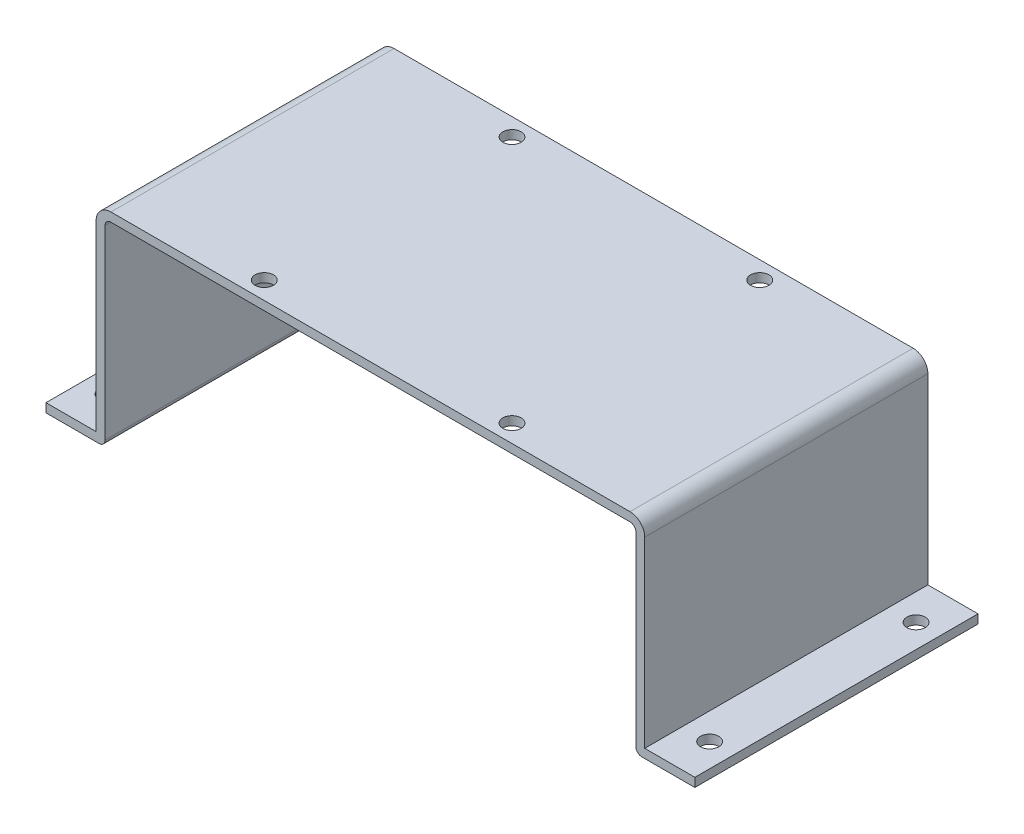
ISO-10303-21;
HEADER;
FILE_DESCRIPTION(('STEP AP214'),'2;1');
FILE_NAME('part.step','',(''),(''),'','','');
FILE_SCHEMA(('AUTOMOTIVE_DESIGN { 1 0 10303 214 1 1 1 1 }'));
ENDSEC;
DATA;
#1=APPLICATION_CONTEXT('core data for automotive mechanical design processes');
#2=APPLICATION_PROTOCOL_DEFINITION('international standard','automotive_design',2000,#1);
#3=PRODUCT_CONTEXT('',#1,'mechanical');
#4=PRODUCT('Part','Part','',(#3));
#5=PRODUCT_RELATED_PRODUCT_CATEGORY('part','',(#4));
#6=PRODUCT_DEFINITION_FORMATION('','',#4);
#7=PRODUCT_DEFINITION_CONTEXT('part definition',#1,'design');
#8=PRODUCT_DEFINITION('design','',#6,#7);
#9=PRODUCT_DEFINITION_SHAPE('','',#8);
#10=(LENGTH_UNIT() NAMED_UNIT(*) SI_UNIT(.MILLI.,.METRE.));
#11=(NAMED_UNIT(*) PLANE_ANGLE_UNIT() SI_UNIT($,.RADIAN.));
#12=(NAMED_UNIT(*) SI_UNIT($,.STERADIAN.) SOLID_ANGLE_UNIT());
#13=UNCERTAINTY_MEASURE_WITH_UNIT(LENGTH_MEASURE(1.E-05),#10,'distance_accuracy_value','');
#14=(GEOMETRIC_REPRESENTATION_CONTEXT(3) GLOBAL_UNCERTAINTY_ASSIGNED_CONTEXT((#13)) GLOBAL_UNIT_ASSIGNED_CONTEXT((#10,
#11,#12)) REPRESENTATION_CONTEXT('',''));
#15=CARTESIAN_POINT('',(0.,0.,0.));
#16=DIRECTION('',(0.,0.,1.));
#17=DIRECTION('',(1.,0.,0.));
#18=AXIS2_PLACEMENT_3D('',#15,#16,#17);
#19=CARTESIAN_POINT('',(-46.,1.5,24.));
#20=DIRECTION('',(0.,-1.,0.));
#21=DIRECTION('',(1.,0.,0.));
#22=AXIS2_PLACEMENT_3D('',#19,#20,#21);
#23=PLANE('',#22);
#24=CARTESIAN_POINT('',(-51.,1.5,17.5));
#25=DIRECTION('',(0.,-1.,0.));
#26=DIRECTION('',(1.,0.,0.));
#27=AXIS2_PLACEMENT_3D('',#24,#25,#26);
#28=CIRCLE('',#27,1.55);
#29=CARTESIAN_POINT('',(-49.45,1.5,17.5));
#30=VERTEX_POINT('',#29);
#31=EDGE_CURVE('E289',#30,#30,#28,.T.);
#32=ORIENTED_EDGE('',*,*,#31,.T.);
#33=EDGE_LOOP('',(#32));
#34=FACE_BOUND('',#33,.T.);
#35=CARTESIAN_POINT('',(-51.,1.5,-17.5));
#36=DIRECTION('',(0.,-1.,0.));
#37=DIRECTION('',(1.,0.,0.));
#38=AXIS2_PLACEMENT_3D('',#35,#36,#37);
#39=CIRCLE('',#38,1.55);
#40=CARTESIAN_POINT('',(-49.45,1.5,-17.5));
#41=VERTEX_POINT('',#40);
#42=EDGE_CURVE('E277',#41,#41,#39,.T.);
#43=ORIENTED_EDGE('',*,*,#42,.T.);
#44=EDGE_LOOP('',(#43));
#45=FACE_BOUND('',#44,.T.);
#46=DIRECTION('',(-1.,0.,0.));
#47=VECTOR('',#46,1.);
#48=CARTESIAN_POINT('',(-46.,1.5,-24.));
#49=LINE('',#48,#47);
#50=CARTESIAN_POINT('',(-46.5,1.5,-24.));
#51=VERTEX_POINT('',#50);
#52=CARTESIAN_POINT('',(-55.,1.5,-24.));
#53=VERTEX_POINT('',#52);
#54=EDGE_CURVE('E191',#51,#53,#49,.T.);
#55=ORIENTED_EDGE('',*,*,#54,.T.);
#56=DIRECTION('',(0.,0.,-1.));
#57=VECTOR('',#56,1.);
#58=CARTESIAN_POINT('',(-55.,1.5,24.));
#59=LINE('',#58,#57);
#60=CARTESIAN_POINT('',(-55.,1.5,24.));
#61=VERTEX_POINT('',#60);
#62=EDGE_CURVE('E11',#61,#53,#59,.T.);
#63=ORIENTED_EDGE('',*,*,#62,.F.);
#64=DIRECTION('',(-1.,0.,0.));
#65=VECTOR('',#64,1.);
#66=CARTESIAN_POINT('',(-46.,1.5,24.));
#67=LINE('',#66,#65);
#68=CARTESIAN_POINT('',(-46.5,1.5,24.));
#69=VERTEX_POINT('',#68);
#70=EDGE_CURVE('E122',#69,#61,#67,.T.);
#71=ORIENTED_EDGE('',*,*,#70,.F.);
#72=DIRECTION('',(0.,0.,-1.));
#73=VECTOR('',#72,1.);
#74=CARTESIAN_POINT('',(-46.5,1.5,24.));
#75=LINE('',#74,#73);
#76=EDGE_CURVE('E187',#69,#51,#75,.T.);
#77=ORIENTED_EDGE('',*,*,#76,.T.);
#78=EDGE_LOOP('',(#55,#63,#71,#77));
#79=FACE_BOUND('',#78,.T.);
#80=ADVANCED_FACE('F34',(#34,#45,#79),#23,.F.);
#81=CARTESIAN_POINT('',(-55.,0.,24.));
#82=DIRECTION('',(-1.,0.,0.));
#83=DIRECTION('',(0.,0.,1.));
#84=AXIS2_PLACEMENT_3D('',#81,#82,#83);
#85=PLANE('',#84);
#86=DIRECTION('',(0.,1.,0.));
#87=VECTOR('',#86,1.);
#88=CARTESIAN_POINT('',(-55.,0.,-24.));
#89=LINE('',#88,#87);
#90=CARTESIAN_POINT('',(-55.,0.,-24.));
#91=VERTEX_POINT('',#90);
#92=EDGE_CURVE('E194',#91,#53,#89,.T.);
#93=ORIENTED_EDGE('',*,*,#92,.F.);
#94=DIRECTION('',(0.,0.,-1.));
#95=VECTOR('',#94,1.);
#96=CARTESIAN_POINT('',(-55.,0.,24.));
#97=LINE('',#96,#95);
#98=CARTESIAN_POINT('',(-55.,0.,24.));
#99=VERTEX_POINT('',#98);
#100=EDGE_CURVE('E43',#99,#91,#97,.T.);
#101=ORIENTED_EDGE('',*,*,#100,.F.);
#102=DIRECTION('',(0.,1.,0.));
#103=VECTOR('',#102,1.);
#104=CARTESIAN_POINT('',(-55.,0.,24.));
#105=LINE('',#104,#103);
#106=EDGE_CURVE('E298',#99,#61,#105,.T.);
#107=ORIENTED_EDGE('',*,*,#106,.T.);
#108=ORIENTED_EDGE('',*,*,#62,.T.);
#109=EDGE_LOOP('',(#93,#101,#107,#108));
#110=FACE_BOUND('',#109,.T.);
#111=ADVANCED_FACE('F361',(#110),#85,.T.);
#112=CARTESIAN_POINT('',(-46.,0.,24.));
#113=DIRECTION('',(0.,-1.,0.));
#114=DIRECTION('',(1.,0.,0.));
#115=AXIS2_PLACEMENT_3D('',#112,#113,#114);
#116=PLANE('',#115);
#117=CARTESIAN_POINT('',(-51.,0.,17.5));
#118=DIRECTION('',(0.,-1.,0.));
#119=DIRECTION('',(1.,0.,0.));
#120=AXIS2_PLACEMENT_3D('',#117,#118,#119);
#121=CIRCLE('',#120,1.55);
#122=CARTESIAN_POINT('',(-49.45,0.,17.5));
#123=VERTEX_POINT('',#122);
#124=EDGE_CURVE('E37',#123,#123,#121,.T.);
#125=ORIENTED_EDGE('',*,*,#124,.F.);
#126=EDGE_LOOP('',(#125));
#127=FACE_BOUND('',#126,.T.);
#128=CARTESIAN_POINT('',(-51.,0.,-17.5));
#129=DIRECTION('',(0.,-1.,0.));
#130=DIRECTION('',(1.,0.,0.));
#131=AXIS2_PLACEMENT_3D('',#128,#129,#130);
#132=CIRCLE('',#131,1.55);
#133=CARTESIAN_POINT('',(-49.45,0.,-17.5));
#134=VERTEX_POINT('',#133);
#135=EDGE_CURVE('E275',#134,#134,#132,.T.);
#136=ORIENTED_EDGE('',*,*,#135,.F.);
#137=EDGE_LOOP('',(#136));
#138=FACE_BOUND('',#137,.T.);
#139=DIRECTION('',(-1.,0.,0.));
#140=VECTOR('',#139,1.);
#141=CARTESIAN_POINT('',(-46.,0.,-24.));
#142=LINE('',#141,#140);
#143=CARTESIAN_POINT('',(-46.,0.,-24.));
#144=VERTEX_POINT('',#143);
#145=EDGE_CURVE('E198',#144,#91,#142,.T.);
#146=ORIENTED_EDGE('',*,*,#145,.F.);
#147=DIRECTION('',(0.,0.,-1.));
#148=VECTOR('',#147,1.);
#149=CARTESIAN_POINT('',(-46.,0.,24.));
#150=LINE('',#149,#148);
#151=CARTESIAN_POINT('',(-46.,0.,24.));
#152=VERTEX_POINT('',#151);
#153=EDGE_CURVE('E264',#152,#144,#150,.T.);
#154=ORIENTED_EDGE('',*,*,#153,.F.);
#155=DIRECTION('',(-1.,0.,0.));
#156=VECTOR('',#155,1.);
#157=CARTESIAN_POINT('',(-46.,0.,24.));
#158=LINE('',#157,#156);
#159=EDGE_CURVE('E301',#152,#99,#158,.T.);
#160=ORIENTED_EDGE('',*,*,#159,.T.);
#161=ORIENTED_EDGE('',*,*,#100,.T.);
#162=EDGE_LOOP('',(#146,#154,#160,#161));
#163=FACE_BOUND('',#162,.T.);
#164=ADVANCED_FACE('F366',(#127,#138,#163),#116,.T.);
#165=CARTESIAN_POINT('',(-46.,1.,24.));
#166=DIRECTION('',(0.,0.,-1.));
#167=DIRECTION('',(-1.,0.,0.));
#168=AXIS2_PLACEMENT_3D('',#165,#166,#167);
#169=CYLINDRICAL_SURFACE('',#168,1.);
#170=CARTESIAN_POINT('',(-46.,1.,-24.));
#171=DIRECTION('',(0.,0.,-1.));
#172=DIRECTION('',(-1.,0.,0.));
#173=AXIS2_PLACEMENT_3D('',#170,#171,#172);
#174=CIRCLE('',#173,1.);
#175=CARTESIAN_POINT('',(-45.,1.,-24.));
#176=VERTEX_POINT('',#175);
#177=EDGE_CURVE('E201',#176,#144,#174,.T.);
#178=ORIENTED_EDGE('',*,*,#177,.F.);
#179=DIRECTION('',(0.,0.,-1.));
#180=VECTOR('',#179,1.);
#181=CARTESIAN_POINT('',(-45.,1.,24.));
#182=LINE('',#181,#180);
#183=CARTESIAN_POINT('',(-45.,1.,24.));
#184=VERTEX_POINT('',#183);
#185=EDGE_CURVE('E262',#184,#176,#182,.T.);
#186=ORIENTED_EDGE('',*,*,#185,.F.);
#187=CARTESIAN_POINT('',(-46.,1.,24.));
#188=DIRECTION('',(0.,0.,-1.));
#189=DIRECTION('',(-1.,0.,0.));
#190=AXIS2_PLACEMENT_3D('',#187,#188,#189);
#191=CIRCLE('',#190,1.);
#192=EDGE_CURVE('E304',#184,#152,#191,.T.);
#193=ORIENTED_EDGE('',*,*,#192,.T.);
#194=ORIENTED_EDGE('',*,*,#153,.T.);
#195=EDGE_LOOP('',(#178,#186,#193,#194));
#196=FACE_BOUND('',#195,.T.);
#197=ADVANCED_FACE('F574',(#196),#169,.T.);
#198=CARTESIAN_POINT('',(-45.,32.5,24.));
#199=DIRECTION('',(1.,0.,0.));
#200=DIRECTION('',(0.,0.,-1.));
#201=AXIS2_PLACEMENT_3D('',#198,#199,#200);
#202=PLANE('',#201);
#203=DIRECTION('',(0.,-1.,0.));
#204=VECTOR('',#203,1.);
#205=CARTESIAN_POINT('',(-45.,32.5,-24.));
#206=LINE('',#205,#204);
#207=CARTESIAN_POINT('',(-45.,32.5,-24.));
#208=VERTEX_POINT('',#207);
#209=EDGE_CURVE('E204',#208,#176,#206,.T.);
#210=ORIENTED_EDGE('',*,*,#209,.F.);
#211=DIRECTION('',(0.,0.,-1.));
#212=VECTOR('',#211,1.);
#213=CARTESIAN_POINT('',(-45.,32.5,24.));
#214=LINE('',#213,#212);
#215=CARTESIAN_POINT('',(-45.,32.5,24.));
#216=VERTEX_POINT('',#215);
#217=EDGE_CURVE('E260',#216,#208,#214,.T.);
#218=ORIENTED_EDGE('',*,*,#217,.F.);
#219=DIRECTION('',(0.,-1.,0.));
#220=VECTOR('',#219,1.);
#221=CARTESIAN_POINT('',(-45.,32.5,24.));
#222=LINE('',#221,#220);
#223=EDGE_CURVE('E307',#216,#184,#222,.T.);
#224=ORIENTED_EDGE('',*,*,#223,.T.);
#225=ORIENTED_EDGE('',*,*,#185,.T.);
#226=EDGE_LOOP('',(#210,#218,#224,#225));
#227=FACE_BOUND('',#226,.T.);
#228=ADVANCED_FACE('F565',(#227),#202,.T.);
#229=CARTESIAN_POINT('',(-44.,32.5,24.));
#230=DIRECTION('',(0.,0.,-1.));
#231=DIRECTION('',(-1.,0.,0.));
#232=AXIS2_PLACEMENT_3D('',#229,#230,#231);
#233=CYLINDRICAL_SURFACE('',#232,0.999999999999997);
#234=CARTESIAN_POINT('',(-44.,32.5,-24.));
#235=DIRECTION('',(0.,0.,1.));
#236=DIRECTION('',(1.,0.,0.));
#237=AXIS2_PLACEMENT_3D('',#234,#235,#236);
#238=CIRCLE('',#237,0.999999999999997);
#239=CARTESIAN_POINT('',(-44.,33.5,-24.));
#240=VERTEX_POINT('',#239);
#241=EDGE_CURVE('E207',#240,#208,#238,.T.);
#242=ORIENTED_EDGE('',*,*,#241,.F.);
#243=DIRECTION('',(0.,0.,-1.));
#244=VECTOR('',#243,1.);
#245=CARTESIAN_POINT('',(-44.,33.5,24.));
#246=LINE('',#245,#244);
#247=CARTESIAN_POINT('',(-44.,33.5,24.));
#248=VERTEX_POINT('',#247);
#249=EDGE_CURVE('E258',#248,#240,#246,.T.);
#250=ORIENTED_EDGE('',*,*,#249,.F.);
#251=CARTESIAN_POINT('',(-44.,32.5,24.));
#252=DIRECTION('',(0.,0.,1.));
#253=DIRECTION('',(1.,0.,0.));
#254=AXIS2_PLACEMENT_3D('',#251,#252,#253);
#255=CIRCLE('',#254,0.999999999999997);
#256=EDGE_CURVE('E310',#248,#216,#255,.T.);
#257=ORIENTED_EDGE('',*,*,#256,.T.);
#258=ORIENTED_EDGE('',*,*,#217,.T.);
#259=EDGE_LOOP('',(#242,#250,#257,#258));
#260=FACE_BOUND('',#259,.T.);
#261=ADVANCED_FACE('F556',(#260),#233,.F.);
#262=CARTESIAN_POINT('',(-44.,33.5,24.));
#263=DIRECTION('',(0.,-1.,0.));
#264=DIRECTION('',(0.,0.,-1.));
#265=AXIS2_PLACEMENT_3D('',#262,#263,#264);
#266=PLANE('',#265);
#267=CARTESIAN_POINT('',(-20.9999999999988,33.5,21.));
#268=DIRECTION('',(0.,-1.,0.));
#269=DIRECTION('',(0.,0.,-1.));
#270=AXIS2_PLACEMENT_3D('',#267,#268,#269);
#271=CIRCLE('',#270,1.55000000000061);
#272=CARTESIAN_POINT('',(-20.9999999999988,33.5,19.4499999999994));
#273=VERTEX_POINT('',#272);
#274=EDGE_CURVE('E271',#273,#273,#271,.T.);
#275=ORIENTED_EDGE('',*,*,#274,.F.);
#276=EDGE_LOOP('',(#275));
#277=FACE_BOUND('',#276,.T.);
#278=CARTESIAN_POINT('',(21.0000000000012,33.5,20.9999999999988));
#279=DIRECTION('',(0.,-1.,0.));
#280=DIRECTION('',(0.,0.,-1.));
#281=AXIS2_PLACEMENT_3D('',#278,#279,#280);
#282=CIRCLE('',#281,1.55000000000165);
#283=CARTESIAN_POINT('',(21.0000000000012,33.5,19.4499999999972));
#284=VERTEX_POINT('',#283);
#285=EDGE_CURVE('E651',#284,#284,#282,.T.);
#286=ORIENTED_EDGE('',*,*,#285,.F.);
#287=EDGE_LOOP('',(#286));
#288=FACE_BOUND('',#287,.T.);
#289=CARTESIAN_POINT('',(21.0000000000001,33.5,-20.9999999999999));
#290=DIRECTION('',(0.,-1.,0.));
#291=DIRECTION('',(0.,0.,-1.));
#292=AXIS2_PLACEMENT_3D('',#289,#290,#291);
#293=CIRCLE('',#292,1.55);
#294=CARTESIAN_POINT('',(21.0000000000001,33.5,-22.5499999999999));
#295=VERTEX_POINT('',#294);
#296=EDGE_CURVE('E655',#295,#295,#293,.T.);
#297=ORIENTED_EDGE('',*,*,#296,.F.);
#298=EDGE_LOOP('',(#297));
#299=FACE_BOUND('',#298,.T.);
#300=CARTESIAN_POINT('',(-21.,33.5,-21.));
#301=DIRECTION('',(0.,-1.,0.));
#302=DIRECTION('',(0.,0.,-1.));
#303=AXIS2_PLACEMENT_3D('',#300,#301,#302);
#304=CIRCLE('',#303,1.55);
#305=CARTESIAN_POINT('',(-21.,33.5,-22.55));
#306=VERTEX_POINT('',#305);
#307=EDGE_CURVE('E195',#306,#306,#304,.T.);
#308=ORIENTED_EDGE('',*,*,#307,.F.);
#309=EDGE_LOOP('',(#308));
#310=FACE_BOUND('',#309,.T.);
#311=DIRECTION('',(-1.,0.,0.));
#312=VECTOR('',#311,1.);
#313=CARTESIAN_POINT('',(-44.,33.5,-24.));
#314=LINE('',#313,#312);
#315=CARTESIAN_POINT('',(44.,33.5,-24.));
#316=VERTEX_POINT('',#315);
#317=EDGE_CURVE('E210',#316,#240,#314,.T.);
#318=ORIENTED_EDGE('',*,*,#317,.F.);
#319=DIRECTION('',(0.,0.,-1.));
#320=VECTOR('',#319,1.);
#321=CARTESIAN_POINT('',(44.,33.5,24.));
#322=LINE('',#321,#320);
#323=CARTESIAN_POINT('',(44.,33.5,24.));
#324=VERTEX_POINT('',#323);
#325=EDGE_CURVE('E256',#324,#316,#322,.T.);
#326=ORIENTED_EDGE('',*,*,#325,.F.);
#327=DIRECTION('',(-1.,0.,0.));
#328=VECTOR('',#327,1.);
#329=CARTESIAN_POINT('',(-44.,33.5,24.));
#330=LINE('',#329,#328);
#331=EDGE_CURVE('E313',#324,#248,#330,.T.);
#332=ORIENTED_EDGE('',*,*,#331,.T.);
#333=ORIENTED_EDGE('',*,*,#249,.T.);
#334=EDGE_LOOP('',(#318,#326,#332,#333));
#335=FACE_BOUND('',#334,.T.);
#336=ADVANCED_FACE('F547',(#277,#288,#299,#310,#335),#266,.T.);
#337=CARTESIAN_POINT('',(44.,32.5,24.));
#338=DIRECTION('',(0.,0.,-1.));
#339=DIRECTION('',(-1.,0.,0.));
#340=AXIS2_PLACEMENT_3D('',#337,#338,#339);
#341=CYLINDRICAL_SURFACE('',#340,0.999999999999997);
#342=CARTESIAN_POINT('',(44.,32.5,-24.));
#343=DIRECTION('',(0.,0.,1.));
#344=DIRECTION('',(-1.,0.,0.));
#345=AXIS2_PLACEMENT_3D('',#342,#343,#344);
#346=CIRCLE('',#345,0.999999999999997);
#347=CARTESIAN_POINT('',(45.,32.5,-24.));
#348=VERTEX_POINT('',#347);
#349=EDGE_CURVE('E213',#348,#316,#346,.T.);
#350=ORIENTED_EDGE('',*,*,#349,.F.);
#351=DIRECTION('',(0.,0.,-1.));
#352=VECTOR('',#351,1.);
#353=CARTESIAN_POINT('',(45.,32.5,24.));
#354=LINE('',#353,#352);
#355=CARTESIAN_POINT('',(45.,32.5,24.));
#356=VERTEX_POINT('',#355);
#357=EDGE_CURVE('E254',#356,#348,#354,.T.);
#358=ORIENTED_EDGE('',*,*,#357,.F.);
#359=CARTESIAN_POINT('',(44.,32.5,24.));
#360=DIRECTION('',(0.,0.,1.));
#361=DIRECTION('',(-1.,0.,0.));
#362=AXIS2_PLACEMENT_3D('',#359,#360,#361);
#363=CIRCLE('',#362,0.999999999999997);
#364=EDGE_CURVE('E316',#356,#324,#363,.T.);
#365=ORIENTED_EDGE('',*,*,#364,.T.);
#366=ORIENTED_EDGE('',*,*,#325,.T.);
#367=EDGE_LOOP('',(#350,#358,#365,#366));
#368=FACE_BOUND('',#367,.T.);
#369=ADVANCED_FACE('F538',(#368),#341,.F.);
#370=CARTESIAN_POINT('',(45.,32.5,24.));
#371=DIRECTION('',(-1.,0.,0.));
#372=DIRECTION('',(0.,0.,1.));
#373=AXIS2_PLACEMENT_3D('',#370,#371,#372);
#374=PLANE('',#373);
#375=DIRECTION('',(0.,1.,0.));
#376=VECTOR('',#375,1.);
#377=CARTESIAN_POINT('',(45.,32.5,-24.));
#378=LINE('',#377,#376);
#379=CARTESIAN_POINT('',(45.,1.,-24.));
#380=VERTEX_POINT('',#379);
#381=EDGE_CURVE('E216',#380,#348,#378,.T.);
#382=ORIENTED_EDGE('',*,*,#381,.F.);
#383=DIRECTION('',(0.,0.,-1.));
#384=VECTOR('',#383,1.);
#385=CARTESIAN_POINT('',(45.,1.,24.));
#386=LINE('',#385,#384);
#387=CARTESIAN_POINT('',(45.,1.,24.));
#388=VERTEX_POINT('',#387);
#389=EDGE_CURVE('E252',#388,#380,#386,.T.);
#390=ORIENTED_EDGE('',*,*,#389,.F.);
#391=DIRECTION('',(0.,1.,0.));
#392=VECTOR('',#391,1.);
#393=CARTESIAN_POINT('',(45.,32.5,24.));
#394=LINE('',#393,#392);
#395=EDGE_CURVE('E319',#388,#356,#394,.T.);
#396=ORIENTED_EDGE('',*,*,#395,.T.);
#397=ORIENTED_EDGE('',*,*,#357,.T.);
#398=EDGE_LOOP('',(#382,#390,#396,#397));
#399=FACE_BOUND('',#398,.T.);
#400=ADVANCED_FACE('F529',(#399),#374,.T.);
#401=CARTESIAN_POINT('',(46.,1.,24.));
#402=DIRECTION('',(0.,0.,-1.));
#403=DIRECTION('',(-1.,0.,0.));
#404=AXIS2_PLACEMENT_3D('',#401,#402,#403);
#405=CYLINDRICAL_SURFACE('',#404,1.);
#406=CARTESIAN_POINT('',(46.,1.,-24.));
#407=DIRECTION('',(0.,0.,-1.));
#408=DIRECTION('',(1.,0.,0.));
#409=AXIS2_PLACEMENT_3D('',#406,#407,#408);
#410=CIRCLE('',#409,1.);
#411=CARTESIAN_POINT('',(46.,0.,-24.));
#412=VERTEX_POINT('',#411);
#413=EDGE_CURVE('E219',#412,#380,#410,.T.);
#414=ORIENTED_EDGE('',*,*,#413,.F.);
#415=DIRECTION('',(0.,0.,-1.));
#416=VECTOR('',#415,1.);
#417=CARTESIAN_POINT('',(46.,0.,24.));
#418=LINE('',#417,#416);
#419=CARTESIAN_POINT('',(46.,0.,24.));
#420=VERTEX_POINT('',#419);
#421=EDGE_CURVE('E250',#420,#412,#418,.T.);
#422=ORIENTED_EDGE('',*,*,#421,.F.);
#423=CARTESIAN_POINT('',(46.,1.,24.));
#424=DIRECTION('',(0.,0.,-1.));
#425=DIRECTION('',(1.,0.,0.));
#426=AXIS2_PLACEMENT_3D('',#423,#424,#425);
#427=CIRCLE('',#426,1.);
#428=EDGE_CURVE('E322',#420,#388,#427,.T.);
#429=ORIENTED_EDGE('',*,*,#428,.T.);
#430=ORIENTED_EDGE('',*,*,#389,.T.);
#431=EDGE_LOOP('',(#414,#422,#429,#430));
#432=FACE_BOUND('',#431,.T.);
#433=ADVANCED_FACE('F520',(#432),#405,.T.);
#434=CARTESIAN_POINT('',(46.,0.,24.));
#435=DIRECTION('',(0.,-1.,0.));
#436=DIRECTION('',(1.,0.,0.));
#437=AXIS2_PLACEMENT_3D('',#434,#435,#436);
#438=PLANE('',#437);
#439=CARTESIAN_POINT('',(51.,0.,-17.5));
#440=DIRECTION('',(0.,-1.,0.));
#441=DIRECTION('',(1.,0.,0.));
#442=AXIS2_PLACEMENT_3D('',#439,#440,#441);
#443=CIRCLE('',#442,1.55);
#444=CARTESIAN_POINT('',(52.55,0.,-17.5));
#445=VERTEX_POINT('',#444);
#446=EDGE_CURVE('E274',#445,#445,#443,.T.);
#447=ORIENTED_EDGE('',*,*,#446,.F.);
#448=EDGE_LOOP('',(#447));
#449=FACE_BOUND('',#448,.T.);
#450=CARTESIAN_POINT('',(51.,0.,17.5));
#451=DIRECTION('',(0.,-1.,0.));
#452=DIRECTION('',(1.,0.,0.));
#453=AXIS2_PLACEMENT_3D('',#450,#451,#452);
#454=CIRCLE('',#453,1.55);
#455=CARTESIAN_POINT('',(52.55,0.,17.5));
#456=VERTEX_POINT('',#455);
#457=EDGE_CURVE('E270',#456,#456,#454,.T.);
#458=ORIENTED_EDGE('',*,*,#457,.F.);
#459=EDGE_LOOP('',(#458));
#460=FACE_BOUND('',#459,.T.);
#461=DIRECTION('',(-1.,0.,0.));
#462=VECTOR('',#461,1.);
#463=CARTESIAN_POINT('',(46.,0.,-24.));
#464=LINE('',#463,#462);
#465=CARTESIAN_POINT('',(55.,0.,-24.));
#466=VERTEX_POINT('',#465);
#467=EDGE_CURVE('E222',#466,#412,#464,.T.);
#468=ORIENTED_EDGE('',*,*,#467,.F.);
#469=DIRECTION('',(0.,0.,-1.));
#470=VECTOR('',#469,1.);
#471=CARTESIAN_POINT('',(55.,0.,24.));
#472=LINE('',#471,#470);
#473=CARTESIAN_POINT('',(55.,0.,24.));
#474=VERTEX_POINT('',#473);
#475=EDGE_CURVE('E248',#474,#466,#472,.T.);
#476=ORIENTED_EDGE('',*,*,#475,.F.);
#477=DIRECTION('',(-1.,0.,0.));
#478=VECTOR('',#477,1.);
#479=CARTESIAN_POINT('',(46.,0.,24.));
#480=LINE('',#479,#478);
#481=EDGE_CURVE('E325',#474,#420,#480,.T.);
#482=ORIENTED_EDGE('',*,*,#481,.T.);
#483=ORIENTED_EDGE('',*,*,#421,.T.);
#484=EDGE_LOOP('',(#468,#476,#482,#483));
#485=FACE_BOUND('',#484,.T.);
#486=ADVANCED_FACE('F511',(#449,#460,#485),#438,.T.);
#487=CARTESIAN_POINT('',(55.,1.5,24.));
#488=DIRECTION('',(1.,0.,0.));
#489=DIRECTION('',(0.,0.,-1.));
#490=AXIS2_PLACEMENT_3D('',#487,#488,#489);
#491=PLANE('',#490);
#492=DIRECTION('',(0.,-1.,0.));
#493=VECTOR('',#492,1.);
#494=CARTESIAN_POINT('',(55.,1.5,-24.));
#495=LINE('',#494,#493);
#496=CARTESIAN_POINT('',(55.,1.5,-24.));
#497=VERTEX_POINT('',#496);
#498=EDGE_CURVE('E225',#497,#466,#495,.T.);
#499=ORIENTED_EDGE('',*,*,#498,.F.);
#500=DIRECTION('',(0.,0.,-1.));
#501=VECTOR('',#500,1.);
#502=CARTESIAN_POINT('',(55.,1.5,24.));
#503=LINE('',#502,#501);
#504=CARTESIAN_POINT('',(55.,1.5,24.));
#505=VERTEX_POINT('',#504);
#506=EDGE_CURVE('E246',#505,#497,#503,.T.);
#507=ORIENTED_EDGE('',*,*,#506,.F.);
#508=DIRECTION('',(0.,-1.,0.));
#509=VECTOR('',#508,1.);
#510=CARTESIAN_POINT('',(55.,1.5,24.));
#511=LINE('',#510,#509);
#512=EDGE_CURVE('E328',#505,#474,#511,.T.);
#513=ORIENTED_EDGE('',*,*,#512,.T.);
#514=ORIENTED_EDGE('',*,*,#475,.T.);
#515=EDGE_LOOP('',(#499,#507,#513,#514));
#516=FACE_BOUND('',#515,.T.);
#517=ADVANCED_FACE('F502',(#516),#491,.T.);
#518=CARTESIAN_POINT('',(46.,1.5,24.));
#519=DIRECTION('',(0.,-1.,0.));
#520=DIRECTION('',(1.,0.,0.));
#521=AXIS2_PLACEMENT_3D('',#518,#519,#520);
#522=PLANE('',#521);
#523=CARTESIAN_POINT('',(51.,1.5,-17.5));
#524=DIRECTION('',(0.,-1.,0.));
#525=DIRECTION('',(1.,0.,0.));
#526=AXIS2_PLACEMENT_3D('',#523,#524,#525);
#527=CIRCLE('',#526,1.55);
#528=CARTESIAN_POINT('',(52.55,1.5,-17.5));
#529=VERTEX_POINT('',#528);
#530=EDGE_CURVE('E272',#529,#529,#527,.T.);
#531=ORIENTED_EDGE('',*,*,#530,.T.);
#532=EDGE_LOOP('',(#531));
#533=FACE_BOUND('',#532,.T.);
#534=CARTESIAN_POINT('',(51.,1.5,17.5));
#535=DIRECTION('',(0.,-1.,0.));
#536=DIRECTION('',(1.,0.,0.));
#537=AXIS2_PLACEMENT_3D('',#534,#535,#536);
#538=CIRCLE('',#537,1.55);
#539=CARTESIAN_POINT('',(52.55,1.5,17.5));
#540=VERTEX_POINT('',#539);
#541=EDGE_CURVE('E267',#540,#540,#538,.T.);
#542=ORIENTED_EDGE('',*,*,#541,.T.);
#543=EDGE_LOOP('',(#542));
#544=FACE_BOUND('',#543,.T.);
#545=DIRECTION('',(-1.,0.,0.));
#546=VECTOR('',#545,1.);
#547=CARTESIAN_POINT('',(46.,1.5,-24.));
#548=LINE('',#547,#546);
#549=CARTESIAN_POINT('',(46.5,1.5,-24.));
#550=VERTEX_POINT('',#549);
#551=EDGE_CURVE('E228',#497,#550,#548,.T.);
#552=ORIENTED_EDGE('',*,*,#551,.T.);
#553=DIRECTION('',(0.,0.,-1.));
#554=VECTOR('',#553,1.);
#555=CARTESIAN_POINT('',(46.5,1.5,24.));
#556=LINE('',#555,#554);
#557=CARTESIAN_POINT('',(46.5,1.5,24.));
#558=VERTEX_POINT('',#557);
#559=EDGE_CURVE('E243',#558,#550,#556,.T.);
#560=ORIENTED_EDGE('',*,*,#559,.F.);
#561=DIRECTION('',(-1.,0.,0.));
#562=VECTOR('',#561,1.);
#563=CARTESIAN_POINT('',(46.,1.5,24.));
#564=LINE('',#563,#562);
#565=EDGE_CURVE('E331',#505,#558,#564,.T.);
#566=ORIENTED_EDGE('',*,*,#565,.F.);
#567=ORIENTED_EDGE('',*,*,#506,.T.);
#568=EDGE_LOOP('',(#552,#560,#566,#567));
#569=FACE_BOUND('',#568,.T.);
#570=ADVANCED_FACE('F494',(#533,#544,#569),#522,.F.);
#571=CARTESIAN_POINT('',(46.5,32.5,24.));
#572=DIRECTION('',(-1.,0.,0.));
#573=DIRECTION('',(0.,0.,1.));
#574=AXIS2_PLACEMENT_3D('',#571,#572,#573);
#575=PLANE('',#574);
#576=DIRECTION('',(0.,1.,0.));
#577=VECTOR('',#576,1.);
#578=CARTESIAN_POINT('',(46.5,32.5,-24.));
#579=LINE('',#578,#577);
#580=CARTESIAN_POINT('',(46.5,32.5,-24.));
#581=VERTEX_POINT('',#580);
#582=EDGE_CURVE('E230',#550,#581,#579,.T.);
#583=ORIENTED_EDGE('',*,*,#582,.T.);
#584=DIRECTION('',(0.,0.,-1.));
#585=VECTOR('',#584,1.);
#586=CARTESIAN_POINT('',(46.5,32.5,24.));
#587=LINE('',#586,#585);
#588=CARTESIAN_POINT('',(46.5,32.5,24.));
#589=VERTEX_POINT('',#588);
#590=EDGE_CURVE('E240',#589,#581,#587,.T.);
#591=ORIENTED_EDGE('',*,*,#590,.F.);
#592=DIRECTION('',(0.,1.,0.));
#593=VECTOR('',#592,1.);
#594=CARTESIAN_POINT('',(46.5,32.5,24.));
#595=LINE('',#594,#593);
#596=EDGE_CURVE('E333',#558,#589,#595,.T.);
#597=ORIENTED_EDGE('',*,*,#596,.F.);
#598=ORIENTED_EDGE('',*,*,#559,.T.);
#599=EDGE_LOOP('',(#583,#591,#597,#598));
#600=FACE_BOUND('',#599,.T.);
#601=ADVANCED_FACE('F340',(#600),#575,.F.);
#602=CARTESIAN_POINT('',(44.,32.5,24.));
#603=DIRECTION('',(0.,0.,-1.));
#604=DIRECTION('',(-1.,0.,0.));
#605=AXIS2_PLACEMENT_3D('',#602,#603,#604);
#606=CYLINDRICAL_SURFACE('',#605,2.5);
#607=CARTESIAN_POINT('',(44.,32.5,-24.));
#608=DIRECTION('',(0.,0.,1.));
#609=DIRECTION('',(1.,0.,0.));
#610=AXIS2_PLACEMENT_3D('',#607,#608,#609);
#611=CIRCLE('',#610,2.5);
#612=CARTESIAN_POINT('',(44.,35.,-24.));
#613=VERTEX_POINT('',#612);
#614=EDGE_CURVE('E232',#581,#613,#611,.T.);
#615=ORIENTED_EDGE('',*,*,#614,.T.);
#616=DIRECTION('',(0.,0.,-1.));
#617=VECTOR('',#616,1.);
#618=CARTESIAN_POINT('',(44.,35.,24.));
#619=LINE('',#618,#617);
#620=CARTESIAN_POINT('',(44.,35.,24.));
#621=VERTEX_POINT('',#620);
#622=EDGE_CURVE('E182',#621,#613,#619,.T.);
#623=ORIENTED_EDGE('',*,*,#622,.F.);
#624=CARTESIAN_POINT('',(44.,32.5,24.));
#625=DIRECTION('',(0.,0.,1.));
#626=DIRECTION('',(1.,0.,0.));
#627=AXIS2_PLACEMENT_3D('',#624,#625,#626);
#628=CIRCLE('',#627,2.5);
#629=EDGE_CURVE('E173',#589,#621,#628,.T.);
#630=ORIENTED_EDGE('',*,*,#629,.F.);
#631=ORIENTED_EDGE('',*,*,#590,.T.);
#632=EDGE_LOOP('',(#615,#623,#630,#631));
#633=FACE_BOUND('',#632,.T.);
#634=ADVANCED_FACE('F344',(#633),#606,.T.);
#635=CARTESIAN_POINT('',(-44.,35.,24.));
#636=DIRECTION('',(0.,-1.,0.));
#637=DIRECTION('',(0.,0.,-1.));
#638=AXIS2_PLACEMENT_3D('',#635,#636,#637);
#639=PLANE('',#638);
#640=CARTESIAN_POINT('',(-20.9999999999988,35.,21.));
#641=DIRECTION('',(0.,1.,0.));
#642=DIRECTION('',(-1.,0.,0.));
#643=AXIS2_PLACEMENT_3D('',#640,#641,#642);
#644=CIRCLE('',#643,1.55000000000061);
#645=CARTESIAN_POINT('',(-22.5499999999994,35.,21.));
#646=VERTEX_POINT('',#645);
#647=EDGE_CURVE('E670',#646,#646,#644,.T.);
#648=ORIENTED_EDGE('',*,*,#647,.F.);
#649=EDGE_LOOP('',(#648));
#650=FACE_BOUND('',#649,.T.);
#651=CARTESIAN_POINT('',(21.0000000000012,35.,20.9999999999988));
#652=DIRECTION('',(0.,1.,0.));
#653=DIRECTION('',(-1.,0.,0.));
#654=AXIS2_PLACEMENT_3D('',#651,#652,#653);
#655=CIRCLE('',#654,1.55000000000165);
#656=CARTESIAN_POINT('',(19.4499999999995,35.,20.9999999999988));
#657=VERTEX_POINT('',#656);
#658=EDGE_CURVE('E664',#657,#657,#655,.T.);
#659=ORIENTED_EDGE('',*,*,#658,.F.);
#660=EDGE_LOOP('',(#659));
#661=FACE_BOUND('',#660,.T.);
#662=CARTESIAN_POINT('',(21.0000000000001,35.,-20.9999999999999));
#663=DIRECTION('',(0.,1.,0.));
#664=DIRECTION('',(-1.,0.,0.));
#665=AXIS2_PLACEMENT_3D('',#662,#663,#664);
#666=CIRCLE('',#665,1.55);
#667=CARTESIAN_POINT('',(19.4500000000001,35.,-20.9999999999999));
#668=VERTEX_POINT('',#667);
#669=EDGE_CURVE('E660',#668,#668,#666,.T.);
#670=ORIENTED_EDGE('',*,*,#669,.F.);
#671=EDGE_LOOP('',(#670));
#672=FACE_BOUND('',#671,.T.);
#673=CARTESIAN_POINT('',(-21.,35.,-21.));
#674=DIRECTION('',(0.,1.,0.));
#675=DIRECTION('',(-1.,0.,0.));
#676=AXIS2_PLACEMENT_3D('',#673,#674,#675);
#677=CIRCLE('',#676,1.55);
#678=CARTESIAN_POINT('',(-22.55,35.,-21.));
#679=VERTEX_POINT('',#678);
#680=EDGE_CURVE('E292',#679,#679,#677,.T.);
#681=ORIENTED_EDGE('',*,*,#680,.F.);
#682=EDGE_LOOP('',(#681));
#683=FACE_BOUND('',#682,.T.);
#684=DIRECTION('',(1.,0.,0.));
#685=VECTOR('',#684,1.);
#686=CARTESIAN_POINT('',(-44.,35.,-24.));
#687=LINE('',#686,#685);
#688=CARTESIAN_POINT('',(-44.,35.,-24.));
#689=VERTEX_POINT('',#688);
#690=EDGE_CURVE('E181',#613,#689,#687,.F.);
#691=ORIENTED_EDGE('',*,*,#690,.T.);
#692=DIRECTION('',(0.,0.,-1.));
#693=VECTOR('',#692,1.);
#694=CARTESIAN_POINT('',(-44.,35.,24.));
#695=LINE('',#694,#693);
#696=CARTESIAN_POINT('',(-44.,35.,24.));
#697=VERTEX_POINT('',#696);
#698=EDGE_CURVE('E178',#697,#689,#695,.T.);
#699=ORIENTED_EDGE('',*,*,#698,.F.);
#700=DIRECTION('',(1.,0.,0.));
#701=VECTOR('',#700,1.);
#702=CARTESIAN_POINT('',(-44.,35.,24.));
#703=LINE('',#702,#701);
#704=EDGE_CURVE('E167',#621,#697,#703,.F.);
#705=ORIENTED_EDGE('',*,*,#704,.F.);
#706=ORIENTED_EDGE('',*,*,#622,.T.);
#707=EDGE_LOOP('',(#691,#699,#705,#706));
#708=FACE_BOUND('',#707,.T.);
#709=ADVANCED_FACE('F179',(#650,#661,#672,#683,#708),#639,.F.);
#710=CARTESIAN_POINT('',(-44.,32.5,24.));
#711=DIRECTION('',(0.,0.,-1.));
#712=DIRECTION('',(-1.,0.,0.));
#713=AXIS2_PLACEMENT_3D('',#710,#711,#712);
#714=CYLINDRICAL_SURFACE('',#713,2.5);
#715=CARTESIAN_POINT('',(-44.,32.5,-24.));
#716=DIRECTION('',(0.,0.,1.));
#717=DIRECTION('',(1.,0.,0.));
#718=AXIS2_PLACEMENT_3D('',#715,#716,#717);
#719=CIRCLE('',#718,2.5);
#720=CARTESIAN_POINT('',(-46.5,32.5,-24.));
#721=VERTEX_POINT('',#720);
#722=EDGE_CURVE('E110',#689,#721,#719,.T.);
#723=ORIENTED_EDGE('',*,*,#722,.T.);
#724=DIRECTION('',(0.,0.,-1.));
#725=VECTOR('',#724,1.);
#726=CARTESIAN_POINT('',(-46.5,32.5,24.));
#727=LINE('',#726,#725);
#728=CARTESIAN_POINT('',(-46.5,32.5,24.));
#729=VERTEX_POINT('',#728);
#730=EDGE_CURVE('E183',#729,#721,#727,.T.);
#731=ORIENTED_EDGE('',*,*,#730,.F.);
#732=CARTESIAN_POINT('',(-44.,32.5,24.));
#733=DIRECTION('',(0.,0.,1.));
#734=DIRECTION('',(1.,0.,0.));
#735=AXIS2_PLACEMENT_3D('',#732,#733,#734);
#736=CIRCLE('',#735,2.5);
#737=EDGE_CURVE('E171',#697,#729,#736,.T.);
#738=ORIENTED_EDGE('',*,*,#737,.F.);
#739=ORIENTED_EDGE('',*,*,#698,.T.);
#740=EDGE_LOOP('',(#723,#731,#738,#739));
#741=FACE_BOUND('',#740,.T.);
#742=ADVANCED_FACE('F185',(#741),#714,.T.);
#743=CARTESIAN_POINT('',(-46.5,32.5,24.));
#744=DIRECTION('',(1.,0.,0.));
#745=DIRECTION('',(0.,0.,-1.));
#746=AXIS2_PLACEMENT_3D('',#743,#744,#745);
#747=PLANE('',#746);
#748=DIRECTION('',(0.,1.,0.));
#749=VECTOR('',#748,1.);
#750=CARTESIAN_POINT('',(-46.5,32.5,-24.));
#751=LINE('',#750,#749);
#752=EDGE_CURVE('E116',#721,#51,#751,.F.);
#753=ORIENTED_EDGE('',*,*,#752,.T.);
#754=ORIENTED_EDGE('',*,*,#76,.F.);
#755=DIRECTION('',(0.,1.,0.));
#756=VECTOR('',#755,1.);
#757=CARTESIAN_POINT('',(-46.5,32.5,24.));
#758=LINE('',#757,#756);
#759=EDGE_CURVE('E52',#729,#69,#758,.F.);
#760=ORIENTED_EDGE('',*,*,#759,.F.);
#761=ORIENTED_EDGE('',*,*,#730,.T.);
#762=EDGE_LOOP('',(#753,#754,#760,#761));
#763=FACE_BOUND('',#762,.T.);
#764=ADVANCED_FACE('F350',(#763),#747,.F.);
#765=CARTESIAN_POINT('',(-46.,1.,24.));
#766=DIRECTION('',(0.,0.,-1.));
#767=DIRECTION('',(-1.,0.,0.));
#768=AXIS2_PLACEMENT_3D('',#765,#766,#767);
#769=PLANE('',#768);
#770=ORIENTED_EDGE('',*,*,#70,.T.);
#771=ORIENTED_EDGE('',*,*,#106,.F.);
#772=ORIENTED_EDGE('',*,*,#159,.F.);
#773=ORIENTED_EDGE('',*,*,#192,.F.);
#774=ORIENTED_EDGE('',*,*,#223,.F.);
#775=ORIENTED_EDGE('',*,*,#256,.F.);
#776=ORIENTED_EDGE('',*,*,#331,.F.);
#777=ORIENTED_EDGE('',*,*,#364,.F.);
#778=ORIENTED_EDGE('',*,*,#395,.F.);
#779=ORIENTED_EDGE('',*,*,#428,.F.);
#780=ORIENTED_EDGE('',*,*,#481,.F.);
#781=ORIENTED_EDGE('',*,*,#512,.F.);
#782=ORIENTED_EDGE('',*,*,#565,.T.);
#783=ORIENTED_EDGE('',*,*,#596,.T.);
#784=ORIENTED_EDGE('',*,*,#629,.T.);
#785=ORIENTED_EDGE('',*,*,#704,.T.);
#786=ORIENTED_EDGE('',*,*,#737,.T.);
#787=ORIENTED_EDGE('',*,*,#759,.T.);
#788=EDGE_LOOP('',(#770,#771,#772,#773,#774,#775,#776,#777,#778,#779,#780,#781,#782,#783,#784,
#785,#786,#787));
#789=FACE_BOUND('',#788,.T.);
#790=ADVANCED_FACE('F169',(#789),#769,.F.);
#791=CARTESIAN_POINT('',(-46.,1.,-24.));
#792=DIRECTION('',(0.,0.,-1.));
#793=DIRECTION('',(-1.,0.,0.));
#794=AXIS2_PLACEMENT_3D('',#791,#792,#793);
#795=PLANE('',#794);
#796=ORIENTED_EDGE('',*,*,#54,.F.);
#797=ORIENTED_EDGE('',*,*,#752,.F.);
#798=ORIENTED_EDGE('',*,*,#722,.F.);
#799=ORIENTED_EDGE('',*,*,#690,.F.);
#800=ORIENTED_EDGE('',*,*,#614,.F.);
#801=ORIENTED_EDGE('',*,*,#582,.F.);
#802=ORIENTED_EDGE('',*,*,#551,.F.);
#803=ORIENTED_EDGE('',*,*,#498,.T.);
#804=ORIENTED_EDGE('',*,*,#467,.T.);
#805=ORIENTED_EDGE('',*,*,#413,.T.);
#806=ORIENTED_EDGE('',*,*,#381,.T.);
#807=ORIENTED_EDGE('',*,*,#349,.T.);
#808=ORIENTED_EDGE('',*,*,#317,.T.);
#809=ORIENTED_EDGE('',*,*,#241,.T.);
#810=ORIENTED_EDGE('',*,*,#209,.T.);
#811=ORIENTED_EDGE('',*,*,#177,.T.);
#812=ORIENTED_EDGE('',*,*,#145,.T.);
#813=ORIENTED_EDGE('',*,*,#92,.T.);
#814=EDGE_LOOP('',(#796,#797,#798,#799,#800,#801,#802,#803,#804,#805,#806,#807,#808,#809,#810,
#811,#812,#813));
#815=FACE_BOUND('',#814,.T.);
#816=ADVANCED_FACE('F347',(#815),#795,.T.);
#817=CARTESIAN_POINT('',(-21.,-10.,-21.));
#818=DIRECTION('',(0.,1.,0.));
#819=DIRECTION('',(-1.,0.,0.));
#820=AXIS2_PLACEMENT_3D('',#817,#818,#819);
#821=CYLINDRICAL_SURFACE('',#820,1.55);
#822=ORIENTED_EDGE('',*,*,#307,.T.);
#823=EDGE_LOOP('',(#822));
#824=FACE_BOUND('',#823,.T.);
#825=ORIENTED_EDGE('',*,*,#680,.T.);
#826=EDGE_LOOP('',(#825));
#827=FACE_BOUND('',#826,.T.);
#828=ADVANCED_FACE('F391',(#824,#827),#821,.F.);
#829=CARTESIAN_POINT('',(21.0000000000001,-10.,-20.9999999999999));
#830=DIRECTION('',(0.,1.,0.));
#831=DIRECTION('',(-1.,0.,0.));
#832=AXIS2_PLACEMENT_3D('',#829,#830,#831);
#833=CYLINDRICAL_SURFACE('',#832,1.55);
#834=ORIENTED_EDGE('',*,*,#296,.T.);
#835=EDGE_LOOP('',(#834));
#836=FACE_BOUND('',#835,.T.);
#837=ORIENTED_EDGE('',*,*,#669,.T.);
#838=EDGE_LOOP('',(#837));
#839=FACE_BOUND('',#838,.T.);
#840=ADVANCED_FACE('F387',(#836,#839),#833,.F.);
#841=CARTESIAN_POINT('',(21.0000000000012,-10.,20.9999999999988));
#842=DIRECTION('',(0.,1.,0.));
#843=DIRECTION('',(-1.,0.,0.));
#844=AXIS2_PLACEMENT_3D('',#841,#842,#843);
#845=CYLINDRICAL_SURFACE('',#844,1.55000000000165);
#846=ORIENTED_EDGE('',*,*,#285,.T.);
#847=EDGE_LOOP('',(#846));
#848=FACE_BOUND('',#847,.T.);
#849=ORIENTED_EDGE('',*,*,#658,.T.);
#850=EDGE_LOOP('',(#849));
#851=FACE_BOUND('',#850,.T.);
#852=ADVANCED_FACE('F390',(#848,#851),#845,.F.);
#853=CARTESIAN_POINT('',(-20.9999999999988,-10.,21.));
#854=DIRECTION('',(0.,1.,0.));
#855=DIRECTION('',(-1.,0.,0.));
#856=AXIS2_PLACEMENT_3D('',#853,#854,#855);
#857=CYLINDRICAL_SURFACE('',#856,1.55000000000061);
#858=ORIENTED_EDGE('',*,*,#274,.T.);
#859=EDGE_LOOP('',(#858));
#860=FACE_BOUND('',#859,.T.);
#861=ORIENTED_EDGE('',*,*,#647,.T.);
#862=EDGE_LOOP('',(#861));
#863=FACE_BOUND('',#862,.T.);
#864=ADVANCED_FACE('F395',(#860,#863),#857,.F.);
#865=CARTESIAN_POINT('',(51.,-10.,17.5));
#866=DIRECTION('',(0.,1.,0.));
#867=DIRECTION('',(-1.,0.,0.));
#868=AXIS2_PLACEMENT_3D('',#865,#866,#867);
#869=CYLINDRICAL_SURFACE('',#868,1.55);
#870=ORIENTED_EDGE('',*,*,#457,.T.);
#871=EDGE_LOOP('',(#870));
#872=FACE_BOUND('',#871,.T.);
#873=ORIENTED_EDGE('',*,*,#541,.F.);
#874=EDGE_LOOP('',(#873));
#875=FACE_BOUND('',#874,.T.);
#876=ADVANCED_FACE('F383',(#872,#875),#869,.F.);
#877=CARTESIAN_POINT('',(51.,-10.,-17.5));
#878=DIRECTION('',(0.,1.,0.));
#879=DIRECTION('',(-1.,0.,0.));
#880=AXIS2_PLACEMENT_3D('',#877,#878,#879);
#881=CYLINDRICAL_SURFACE('',#880,1.55);
#882=ORIENTED_EDGE('',*,*,#446,.T.);
#883=EDGE_LOOP('',(#882));
#884=FACE_BOUND('',#883,.T.);
#885=ORIENTED_EDGE('',*,*,#530,.F.);
#886=EDGE_LOOP('',(#885));
#887=FACE_BOUND('',#886,.T.);
#888=ADVANCED_FACE('F375',(#884,#887),#881,.F.);
#889=CARTESIAN_POINT('',(-51.,-10.,-17.5));
#890=DIRECTION('',(0.,1.,0.));
#891=DIRECTION('',(-1.,0.,0.));
#892=AXIS2_PLACEMENT_3D('',#889,#890,#891);
#893=CYLINDRICAL_SURFACE('',#892,1.55);
#894=ORIENTED_EDGE('',*,*,#135,.T.);
#895=EDGE_LOOP('',(#894));
#896=FACE_BOUND('',#895,.T.);
#897=ORIENTED_EDGE('',*,*,#42,.F.);
#898=EDGE_LOOP('',(#897));
#899=FACE_BOUND('',#898,.T.);
#900=ADVANCED_FACE('F372',(#896,#899),#893,.F.);
#901=CARTESIAN_POINT('',(-51.,-10.,17.5));
#902=DIRECTION('',(0.,1.,0.));
#903=DIRECTION('',(-1.,0.,0.));
#904=AXIS2_PLACEMENT_3D('',#901,#902,#903);
#905=CYLINDRICAL_SURFACE('',#904,1.55);
#906=ORIENTED_EDGE('',*,*,#124,.T.);
#907=EDGE_LOOP('',(#906));
#908=FACE_BOUND('',#907,.T.);
#909=ORIENTED_EDGE('',*,*,#31,.F.);
#910=EDGE_LOOP('',(#909));
#911=FACE_BOUND('',#910,.T.);
#912=ADVANCED_FACE('F374',(#908,#911),#905,.F.);
#913=CLOSED_SHELL('',(#80,#111,#164,#197,#228,#261,#336,#369,#400,#433,#486,#517,#570,#601,#634,
#709,#742,#764,#790,#816,#828,#840,#852,#864,#876,#888,#900,#912));
#914=MANIFOLD_SOLID_BREP('B2',#913);
#915=ADVANCED_BREP_SHAPE_REPRESENTATION('',(#18,#914),#14);
#916=SHAPE_DEFINITION_REPRESENTATION(#9,#915);
ENDSEC;
END-ISO-10303-21;
